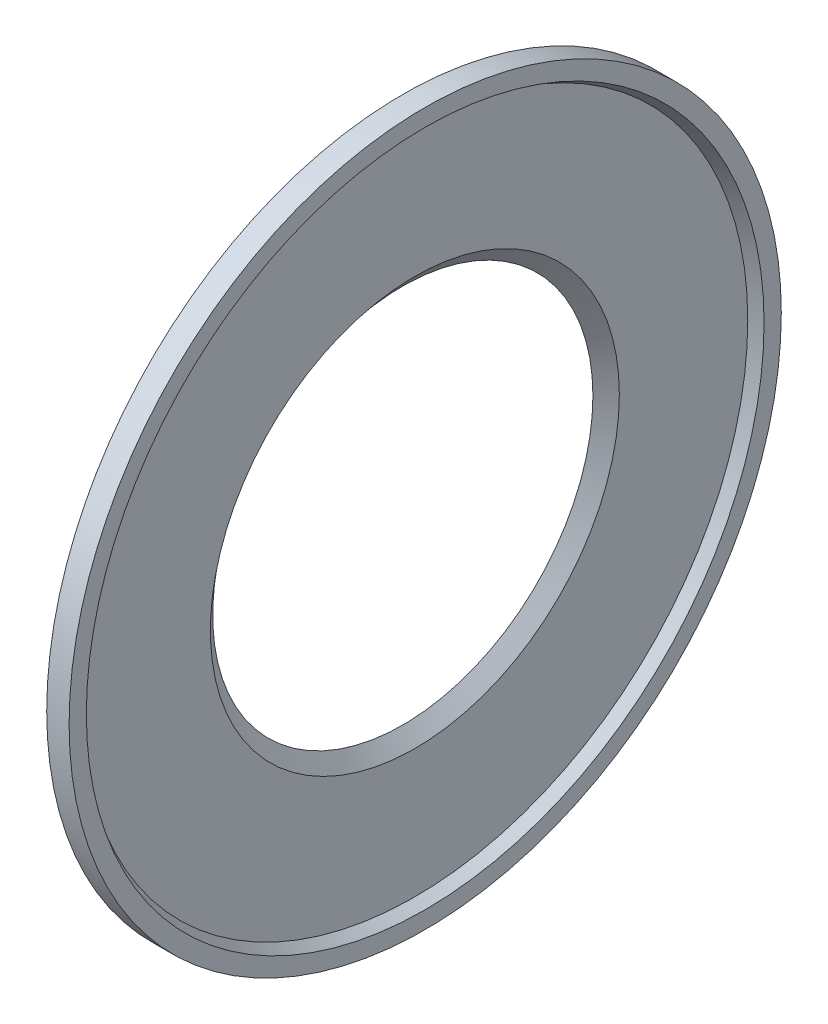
ISO-10303-21;
HEADER;
FILE_DESCRIPTION(('STEP AP214'),'2;1');
FILE_NAME('part.step','',(''),(''),'','','');
FILE_SCHEMA(('AUTOMOTIVE_DESIGN { 1 0 10303 214 1 1 1 1 }'));
ENDSEC;
DATA;
#1=APPLICATION_CONTEXT('core data for automotive mechanical design processes');
#2=APPLICATION_PROTOCOL_DEFINITION('international standard','automotive_design',2000,#1);
#3=PRODUCT_CONTEXT('',#1,'mechanical');
#4=PRODUCT('Part','Part','',(#3));
#5=PRODUCT_RELATED_PRODUCT_CATEGORY('part','',(#4));
#6=PRODUCT_DEFINITION_FORMATION('','',#4);
#7=PRODUCT_DEFINITION_CONTEXT('part definition',#1,'design');
#8=PRODUCT_DEFINITION('design','',#6,#7);
#9=PRODUCT_DEFINITION_SHAPE('','',#8);
#10=(LENGTH_UNIT() NAMED_UNIT(*) SI_UNIT(.MILLI.,.METRE.));
#11=(NAMED_UNIT(*) PLANE_ANGLE_UNIT() SI_UNIT($,.RADIAN.));
#12=(NAMED_UNIT(*) SI_UNIT($,.STERADIAN.) SOLID_ANGLE_UNIT());
#13=UNCERTAINTY_MEASURE_WITH_UNIT(LENGTH_MEASURE(1.E-05),#10,'distance_accuracy_value','');
#14=(GEOMETRIC_REPRESENTATION_CONTEXT(3) GLOBAL_UNCERTAINTY_ASSIGNED_CONTEXT((#13)) GLOBAL_UNIT_ASSIGNED_CONTEXT((#10,
#11,#12)) REPRESENTATION_CONTEXT('',''));
#15=CARTESIAN_POINT('',(0.,0.,0.));
#16=DIRECTION('',(0.,0.,1.));
#17=DIRECTION('',(1.,0.,0.));
#18=AXIS2_PLACEMENT_3D('',#15,#16,#17);
#19=CARTESIAN_POINT('',(0.779999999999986,0.,0.));
#20=DIRECTION('',(1.,0.,0.));
#21=DIRECTION('',(0.,0.,-1.));
#22=AXIS2_PLACEMENT_3D('',#19,#20,#21);
#23=CONICAL_SURFACE('',#22,11.8,0.523598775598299);
#24=CARTESIAN_POINT('',(0.419999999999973,0.,0.));
#25=DIRECTION('',(1.,0.,0.));
#26=DIRECTION('',(0.,0.,-1.));
#27=AXIS2_PLACEMENT_3D('',#24,#25,#26);
#28=CIRCLE('',#27,11.5921539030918);
#29=CARTESIAN_POINT('',(0.419999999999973,0.,-11.5921539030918));
#30=VERTEX_POINT('',#29);
#31=EDGE_CURVE('E33',#30,#30,#28,.T.);
#32=ORIENTED_EDGE('',*,*,#31,.F.);
#33=EDGE_LOOP('',(#32));
#34=FACE_BOUND('',#33,.T.);
#35=CARTESIAN_POINT('',(0.779999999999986,0.,0.));
#36=DIRECTION('',(1.,0.,0.));
#37=DIRECTION('',(0.,0.,-1.));
#38=AXIS2_PLACEMENT_3D('',#35,#36,#37);
#39=CIRCLE('',#38,11.8);
#40=CARTESIAN_POINT('',(0.779999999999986,0.,-11.8));
#41=VERTEX_POINT('',#40);
#42=EDGE_CURVE('E17',#41,#41,#39,.F.);
#43=ORIENTED_EDGE('',*,*,#42,.F.);
#44=EDGE_LOOP('',(#43));
#45=FACE_BOUND('',#44,.T.);
#46=ADVANCED_FACE('F14',(#34,#45),#23,.F.);
#47=CARTESIAN_POINT('',(0.78,12.1,0.));
#48=DIRECTION('',(1.,0.,0.));
#49=DIRECTION('',(0.,1.,0.));
#50=AXIS2_PLACEMENT_3D('',#47,#48,#49);
#51=PLANE('',#50);
#52=ORIENTED_EDGE('',*,*,#42,.T.);
#53=EDGE_LOOP('',(#52));
#54=FACE_BOUND('',#53,.T.);
#55=CARTESIAN_POINT('',(0.78,0.,0.));
#56=DIRECTION('',(-1.,0.,0.));
#57=DIRECTION('',(0.,0.,1.));
#58=AXIS2_PLACEMENT_3D('',#55,#56,#57);
#59=CIRCLE('',#58,12.4);
#60=CARTESIAN_POINT('',(0.78,0.,12.4));
#61=VERTEX_POINT('',#60);
#62=EDGE_CURVE('E31',#61,#61,#59,.T.);
#63=ORIENTED_EDGE('',*,*,#62,.F.);
#64=EDGE_LOOP('',(#63));
#65=FACE_BOUND('',#64,.T.);
#66=ADVANCED_FACE('F40',(#54,#65),#51,.T.);
#67=CARTESIAN_POINT('',(0.42,9.35634520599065,0.));
#68=DIRECTION('',(1.,0.,0.));
#69=DIRECTION('',(0.,0.,-1.));
#70=AXIS2_PLACEMENT_3D('',#67,#68,#69);
#71=PLANE('',#70);
#72=CARTESIAN_POINT('',(0.420000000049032,0.,0.));
#73=DIRECTION('',(1.,0.,0.));
#74=DIRECTION('',(0.,0.,-1.));
#75=AXIS2_PLACEMENT_3D('',#72,#73,#74);
#76=CIRCLE('',#75,7.12053650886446);
#77=CARTESIAN_POINT('',(0.420000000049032,0.,-7.12053650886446));
#78=VERTEX_POINT('',#77);
#79=EDGE_CURVE('E26',#78,#78,#76,.F.);
#80=ORIENTED_EDGE('',*,*,#79,.T.);
#81=EDGE_LOOP('',(#80));
#82=FACE_BOUND('',#81,.T.);
#83=ORIENTED_EDGE('',*,*,#31,.T.);
#84=EDGE_LOOP('',(#83));
#85=FACE_BOUND('',#84,.T.);
#86=ADVANCED_FACE('F49',(#82,#85),#71,.T.);
#87=CARTESIAN_POINT('',(0.39,0.,0.));
#88=DIRECTION('',(-1.,0.,0.));
#89=DIRECTION('',(0.,0.,1.));
#90=AXIS2_PLACEMENT_3D('',#87,#88,#89);
#91=CYLINDRICAL_SURFACE('',#90,12.4);
#92=ORIENTED_EDGE('',*,*,#62,.T.);
#93=EDGE_LOOP('',(#92));
#94=FACE_BOUND('',#93,.T.);
#95=CARTESIAN_POINT('',(0.,0.,0.));
#96=DIRECTION('',(-1.,0.,0.));
#97=DIRECTION('',(0.,0.,1.));
#98=AXIS2_PLACEMENT_3D('',#95,#96,#97);
#99=CIRCLE('',#98,12.4);
#100=CARTESIAN_POINT('',(0.,0.,12.4));
#101=VERTEX_POINT('',#100);
#102=EDGE_CURVE('E21',#101,#101,#99,.T.);
#103=ORIENTED_EDGE('',*,*,#102,.F.);
#104=EDGE_LOOP('',(#103));
#105=FACE_BOUND('',#104,.T.);
#106=ADVANCED_FACE('F57',(#94,#105),#91,.T.);
#107=CARTESIAN_POINT('',(0.41999999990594,0.,0.));
#108=DIRECTION('',(1.,0.,0.));
#109=DIRECTION('',(0.,0.,-1.));
#110=AXIS2_PLACEMENT_3D('',#107,#108,#109);
#111=CONICAL_SURFACE('',#110,7.12053650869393,0.872664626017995);
#112=CARTESIAN_POINT('',(8.62484996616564E-11,0.,0.));
#113=DIRECTION('',(1.,0.,0.));
#114=DIRECTION('',(0.,0.,-1.));
#115=AXIS2_PLACEMENT_3D('',#112,#113,#114);
#116=CIRCLE('',#115,6.61999999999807);
#117=CARTESIAN_POINT('',(8.62484996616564E-11,0.,-6.61999999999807));
#118=VERTEX_POINT('',#117);
#119=EDGE_CURVE('E10',#118,#118,#116,.T.);
#120=ORIENTED_EDGE('',*,*,#119,.F.);
#121=EDGE_LOOP('',(#120));
#122=FACE_BOUND('',#121,.T.);
#123=ORIENTED_EDGE('',*,*,#79,.F.);
#124=EDGE_LOOP('',(#123));
#125=FACE_BOUND('',#124,.T.);
#126=ADVANCED_FACE('F52',(#122,#125),#111,.F.);
#127=CARTESIAN_POINT('',(0.,9.51,0.));
#128=DIRECTION('',(-1.,0.,0.));
#129=DIRECTION('',(0.,0.,1.));
#130=AXIS2_PLACEMENT_3D('',#127,#128,#129);
#131=PLANE('',#130);
#132=ORIENTED_EDGE('',*,*,#119,.T.);
#133=EDGE_LOOP('',(#132));
#134=FACE_BOUND('',#133,.T.);
#135=ORIENTED_EDGE('',*,*,#102,.T.);
#136=EDGE_LOOP('',(#135));
#137=FACE_BOUND('',#136,.T.);
#138=ADVANCED_FACE('F50',(#134,#137),#131,.T.);
#139=CLOSED_SHELL('',(#46,#66,#86,#106,#126,#138));
#140=MANIFOLD_SOLID_BREP('B1',#139);
#141=ADVANCED_BREP_SHAPE_REPRESENTATION('',(#18,#140),#14);
#142=SHAPE_DEFINITION_REPRESENTATION(#9,#141);
ENDSEC;
END-ISO-10303-21;
